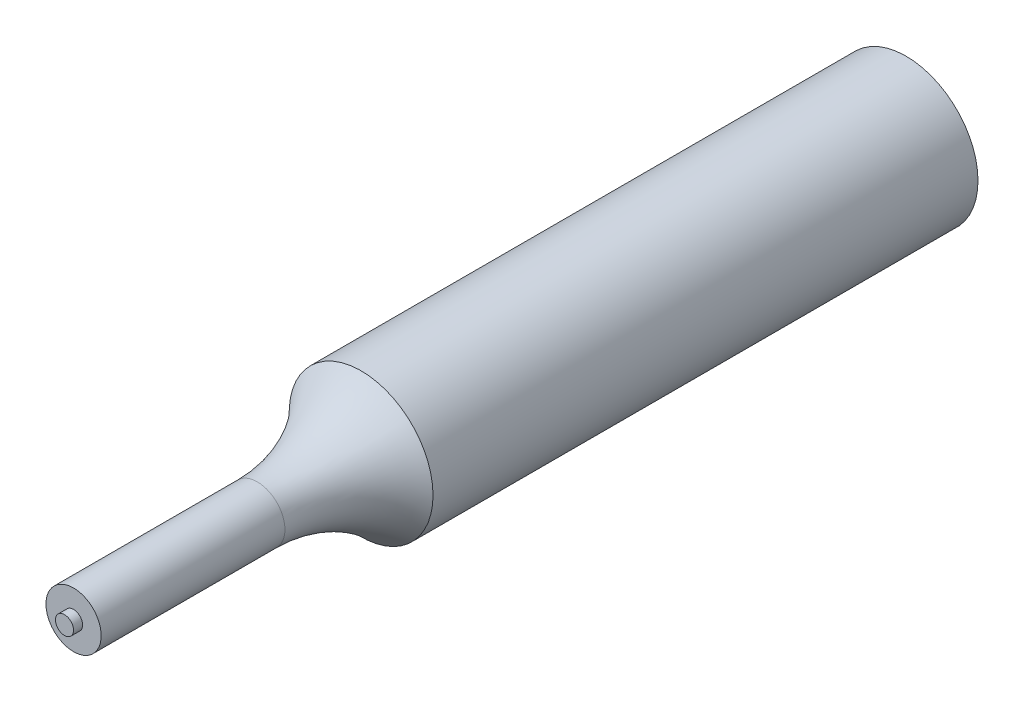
ISO-10303-21;
HEADER;
FILE_DESCRIPTION(('STEP AP214'),'2;1');
FILE_NAME('part.step','',(''),(''),'','','');
FILE_SCHEMA(('AUTOMOTIVE_DESIGN { 1 0 10303 214 1 1 1 1 }'));
ENDSEC;
DATA;
#1=APPLICATION_CONTEXT('core data for automotive mechanical design processes');
#2=APPLICATION_PROTOCOL_DEFINITION('international standard','automotive_design',2000,#1);
#3=PRODUCT_CONTEXT('',#1,'mechanical');
#4=PRODUCT('Part','Part','',(#3));
#5=PRODUCT_RELATED_PRODUCT_CATEGORY('part','',(#4));
#6=PRODUCT_DEFINITION_FORMATION('','',#4);
#7=PRODUCT_DEFINITION_CONTEXT('part definition',#1,'design');
#8=PRODUCT_DEFINITION('design','',#6,#7);
#9=PRODUCT_DEFINITION_SHAPE('','',#8);
#10=(LENGTH_UNIT() NAMED_UNIT(*) SI_UNIT(.MILLI.,.METRE.));
#11=(NAMED_UNIT(*) PLANE_ANGLE_UNIT() SI_UNIT($,.RADIAN.));
#12=(NAMED_UNIT(*) SI_UNIT($,.STERADIAN.) SOLID_ANGLE_UNIT());
#13=UNCERTAINTY_MEASURE_WITH_UNIT(LENGTH_MEASURE(1.E-05),#10,'distance_accuracy_value','');
#14=(GEOMETRIC_REPRESENTATION_CONTEXT(3) GLOBAL_UNCERTAINTY_ASSIGNED_CONTEXT((#13)) GLOBAL_UNIT_ASSIGNED_CONTEXT((#10,
#11,#12)) REPRESENTATION_CONTEXT('',''));
#15=CARTESIAN_POINT('',(0.,0.,0.));
#16=DIRECTION('',(0.,0.,1.));
#17=DIRECTION('',(1.,0.,0.));
#18=AXIS2_PLACEMENT_3D('',#15,#16,#17);
#19=CARTESIAN_POINT('',(-6.35,0.,6.35));
#20=DIRECTION('',(0.,0.,1.));
#21=DIRECTION('',(1.,0.,0.));
#22=AXIS2_PLACEMENT_3D('',#19,#20,#21);
#23=PLANE('',#22);
#24=CARTESIAN_POINT('',(0.,0.,6.35));
#25=DIRECTION('',(0.,0.,1.));
#26=DIRECTION('',(1.,0.,0.));
#27=AXIS2_PLACEMENT_3D('',#24,#25,#26);
#28=CIRCLE('',#27,6.35);
#29=CARTESIAN_POINT('',(6.35,0.,6.35));
#30=VERTEX_POINT('',#29);
#31=EDGE_CURVE('E64',#30,#30,#28,.T.);
#32=ORIENTED_EDGE('',*,*,#31,.F.);
#33=EDGE_LOOP('',(#32));
#34=FACE_BOUND('',#33,.T.);
#35=ADVANCED_FACE('F41',(#34),#23,.F.);
#36=CARTESIAN_POINT('',(0.,0.,43.5171681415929));
#37=DIRECTION('',(0.,0.,1.));
#38=DIRECTION('',(1.,0.,0.));
#39=AXIS2_PLACEMENT_3D('',#36,#37,#38);
#40=CYLINDRICAL_SURFACE('',#39,6.35);
#41=CARTESIAN_POINT('',(-4.84267088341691,-4.10743700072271,25.179099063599));
#42=CARTESIAN_POINT('',(-4.91031116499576,-4.02766520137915,24.7923213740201));
#43=CARTESIAN_POINT('',(-4.97622022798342,-3.94598660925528,24.4056305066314));
#44=CARTESIAN_POINT('',(-5.10457037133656,-3.77849789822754,23.6325148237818));
#45=CARTESIAN_POINT('',(-5.16701100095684,-3.69268724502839,23.246090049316));
#46=CARTESIAN_POINT('',(-5.28869128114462,-3.51621627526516,22.471853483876));
#47=CARTESIAN_POINT('',(-5.3479142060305,-3.42553473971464,22.0840438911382));
#48=CARTESIAN_POINT('',(-5.46281264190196,-3.23916217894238,21.3091382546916));
#49=CARTESIAN_POINT('',(-5.51848847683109,-3.1434716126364,20.9220421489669));
#50=CARTESIAN_POINT('',(-5.62775930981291,-2.94349561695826,20.1381975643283));
#51=CARTESIAN_POINT('',(-5.68125471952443,-2.83904602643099,19.7414769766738));
#52=CARTESIAN_POINT('',(-5.78445697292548,-2.62240574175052,18.9495188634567));
#53=CARTESIAN_POINT('',(-5.83416278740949,-2.51021296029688,18.5542817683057));
#54=CARTESIAN_POINT('',(-5.90576107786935,-2.33419370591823,17.9638277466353));
#55=CARTESIAN_POINT('',(-5.9291108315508,-2.27429911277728,17.7676144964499));
#56=CARTESIAN_POINT('',(-5.9748282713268,-2.15133460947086,17.3760731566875));
#57=CARTESIAN_POINT('',(-5.99719599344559,-2.08826481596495,17.1807450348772));
#58=CARTESIAN_POINT('',(-6.04091673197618,-1.95819561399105,16.7913811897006));
#59=CARTESIAN_POINT('',(-6.06227019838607,-1.89119797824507,16.5973449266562));
#60=CARTESIAN_POINT('',(-6.10393304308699,-1.75208332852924,16.2110122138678));
#61=CARTESIAN_POINT('',(-6.12424257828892,-1.67996708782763,16.0187155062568));
#62=CARTESIAN_POINT('',(-6.15380231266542,-1.56675228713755,15.7329471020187));
#63=CARTESIAN_POINT('',(-6.16347241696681,-1.52831758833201,15.63846410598));
#64=CARTESIAN_POINT('',(-6.1825245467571,-1.4493256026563,15.450339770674));
#65=CARTESIAN_POINT('',(-6.19190652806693,-1.40876799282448,15.3566985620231));
#66=CARTESIAN_POINT('',(-6.21036679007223,-1.32502361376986,15.1704738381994));
#67=CARTESIAN_POINT('',(-6.21944483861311,-1.28183490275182,15.0778911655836));
#68=CARTESIAN_POINT('',(-6.23725256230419,-1.19216789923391,14.8943241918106));
#69=CARTESIAN_POINT('',(-6.24598231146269,-1.1456903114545,14.8033395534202));
#70=CARTESIAN_POINT('',(-6.26502899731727,-1.03713912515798,14.6026879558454));
#71=CARTESIAN_POINT('',(-6.27524324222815,-0.973951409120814,14.4935938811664));
#72=CARTESIAN_POINT('',(-6.28993321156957,-0.872007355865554,14.3346767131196));
#73=CARTESIAN_POINT('',(-6.29471851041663,-0.836885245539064,14.2825598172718));
#74=CARTESIAN_POINT('',(-6.30403025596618,-0.76359266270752,14.1805061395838));
#75=CARTESIAN_POINT('',(-6.30855685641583,-0.725424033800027,14.1305680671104));
#76=CARTESIAN_POINT('',(-6.3167242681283,-0.650185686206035,14.0399236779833));
#77=CARTESIAN_POINT('',(-6.32040505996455,-0.613575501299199,13.9988438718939));
#78=CARTESIAN_POINT('',(-6.32741951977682,-0.536439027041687,13.9201768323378));
#79=CARTESIAN_POINT('',(-6.33075208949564,-0.495901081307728,13.8826006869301));
#80=CARTESIAN_POINT('',(-6.33694554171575,-0.409326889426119,13.8124695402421));
#81=CARTESIAN_POINT('',(-6.33979699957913,-0.363205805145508,13.7800155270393));
#82=CARTESIAN_POINT('',(-6.34463224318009,-0.265487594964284,13.7248093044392));
#83=CARTESIAN_POINT('',(-6.34662196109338,-0.213931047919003,13.7019907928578));
#84=CARTESIAN_POINT('',(-6.34875500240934,-0.129467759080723,13.6774958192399));
#85=CARTESIAN_POINT('',(-6.34932391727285,-0.097991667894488,13.6709525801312));
#86=CARTESIAN_POINT('',(-6.34998629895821,-0.0343716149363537,13.6633332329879));
#87=CARTESIAN_POINT('',(-6.35008005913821,-0.00222807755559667,13.6622537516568));
#88=CARTESIAN_POINT('',(-6.34978056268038,0.0617275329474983,13.6656997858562));
#89=CARTESIAN_POINT('',(-6.34938755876,0.0935397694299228,13.6702223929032));
#90=CARTESIAN_POINT('',(-6.34816036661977,0.156013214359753,13.6843262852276));
#91=CARTESIAN_POINT('',(-6.34732566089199,0.186673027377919,13.6939135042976));
#92=CARTESIAN_POINT('',(-6.34482209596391,0.260065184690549,13.7226150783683));
#93=CARTESIAN_POINT('',(-6.34294612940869,0.301858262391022,13.7440834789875));
#94=CARTESIAN_POINT('',(-6.33864739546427,0.38165159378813,13.793095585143));
#95=CARTESIAN_POINT('',(-6.33622323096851,0.419641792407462,13.8206548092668));
#96=CARTESIAN_POINT('',(-6.33048242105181,0.499390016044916,13.8856462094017));
#97=CARTESIAN_POINT('',(-6.32708403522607,0.540416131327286,13.9239538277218));
#98=CARTESIAN_POINT('',(-6.31991582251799,0.618632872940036,14.0043143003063));
#99=CARTESIAN_POINT('',(-6.31614532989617,0.655816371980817,14.0463738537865));
#100=CARTESIAN_POINT('',(-6.30831294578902,0.727315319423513,14.1332452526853));
#101=CARTESIAN_POINT('',(-6.30424941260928,0.761611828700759,14.1780723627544));
#102=CARTESIAN_POINT('',(-6.29591643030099,0.827671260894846,14.2694579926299));
#103=CARTESIAN_POINT('',(-6.29164716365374,0.859436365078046,14.3160149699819));
#104=CARTESIAN_POINT('',(-6.27903822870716,0.948507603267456,14.4526950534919));
#105=CARTESIAN_POINT('',(-6.27047768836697,1.00320772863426,14.5444903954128));
#106=CARTESIAN_POINT('',(-6.25289089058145,1.10753607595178,14.7308978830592));
#107=CARTESIAN_POINT('',(-6.24386430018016,1.15716059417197,14.8255120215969));
#108=CARTESIAN_POINT('',(-6.22540152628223,1.2526961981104,15.01681191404));
#109=CARTESIAN_POINT('',(-6.21596447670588,1.29859878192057,15.1135018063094));
#110=CARTESIAN_POINT('',(-6.1967416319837,1.38742561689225,15.3082116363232));
#111=CARTESIAN_POINT('',(-6.18695578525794,1.43034942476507,15.4062317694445));
#112=CARTESIAN_POINT('',(-6.15702657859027,1.55595508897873,15.7026425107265));
#113=CARTESIAN_POINT('',(-6.13639643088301,1.63504712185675,15.9025024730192));
#114=CARTESIAN_POINT('',(-6.0939967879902,1.78657264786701,16.3042250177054));
#115=CARTESIAN_POINT('',(-6.0722290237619,1.85901581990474,16.5060841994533));
#116=CARTESIAN_POINT('',(-6.03036939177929,1.99029543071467,16.8860423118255));
#117=CARTESIAN_POINT('',(-6.01040779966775,2.04970121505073,17.0639597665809));
#118=CARTESIAN_POINT('',(-5.9696550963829,2.1655203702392,17.4206719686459));
#119=CARTESIAN_POINT('',(-5.94886396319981,2.22193366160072,17.5994667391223));
#120=CARTESIAN_POINT('',(-5.88526310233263,2.38751102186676,18.1368946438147));
#121=CARTESIAN_POINT('',(-5.84123182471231,2.49299442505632,18.4965176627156));
#122=CARTESIAN_POINT('',(-5.74991915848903,2.69692067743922,19.2179005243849));
#123=CARTESIAN_POINT('',(-5.7026330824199,2.79535293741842,19.5796627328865));
#124=CARTESIAN_POINT('',(-5.60490949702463,2.98647037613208,20.3042400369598));
#125=CARTESIAN_POINT('',(-5.55447226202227,3.0791560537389,20.6670550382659));
#126=CARTESIAN_POINT('',(-5.45303116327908,3.25526543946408,21.3755236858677));
#127=CARTESIAN_POINT('',(-5.40217781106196,3.33892049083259,21.7211416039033));
#128=CARTESIAN_POINT('',(-5.29765509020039,3.50239341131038,22.4128681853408));
#129=CARTESIAN_POINT('',(-5.24398564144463,3.58221117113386,22.7589768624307));
#130=CARTESIAN_POINT('',(-5.13398766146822,3.73814880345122,23.4506312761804));
#131=CARTESIAN_POINT('',(-5.07766643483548,3.81427778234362,23.7961761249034));
#132=CARTESIAN_POINT('',(-4.9622484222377,3.96326100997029,24.487489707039));
#133=CARTESIAN_POINT('',(-4.90315177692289,4.03611542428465,24.8332584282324));
#134=CARTESIAN_POINT('',(-4.84267088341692,4.10743700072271,25.179099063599));
#135=B_SPLINE_CURVE_WITH_KNOTS('',3,(#41,#42,#43,#44,#45,#46,#47,#48,#49,#50,#51,#52,#53,#54,
#55,#56,#57,#58,#59,#60,#61,#62,#63,#64,#65,#66,#67,#68,#69,#70,#71,#72,#73,#74,#75,#76,#77,#78,
#79,#80,#81,#82,#83,#84,#85,#86,#87,#88,#89,#90,#91,#92,#93,#94,#95,#96,#97,#98,#99,#100,#101,
#102,#103,#104,#105,#106,#107,#108,#109,#110,#111,#112,#113,#114,#115,#116,#117,#118,#119,#120,
#121,#122,#123,#124,#125,#126,#127,#128,#129,#130,#131,#132,#133,#134),.UNSPECIFIED.,.F.,.F.,(4,
2,2,2,2,2,2,2,2,2,2,2,2,2,2,2,2,2,2,2,2,2,2,2,2,2,2,2,2,2,2,2,2,2,2,2,2,2,2,2,2,2,2,2,2,2,4),
(0.,1.20200424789,2.40416434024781,3.61207023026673,4.81986564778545,6.06093657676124,
7.3023433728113,7.92174916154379,8.54113220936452,9.16023783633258,9.77925013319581,
10.0866059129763,10.3940085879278,10.7016409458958,11.0092075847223,11.3882604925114,
11.5772698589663,11.7661657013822,11.9314380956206,12.0972169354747,12.2659389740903,
12.4334803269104,12.5295220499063,12.6255044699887,12.7214370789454,12.8174823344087,
12.9577382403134,13.0983557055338,13.2666724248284,13.4352959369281,13.6049511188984,
13.7744584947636,14.0957863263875,14.4173469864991,14.7396226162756,15.0619461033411,
15.7095337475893,16.3561632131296,16.9220256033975,17.4879030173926,18.6198287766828,
19.7534202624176,20.8869132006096,21.9645270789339,23.0421716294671,24.1170039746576,
25.1917819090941),.UNSPECIFIED.);
#136=CARTESIAN_POINT('',(-4.84270585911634,-4.10739576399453,25.178899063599));
#137=VERTEX_POINT('',#136);
#138=CARTESIAN_POINT('',(-4.84270585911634,4.10739576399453,25.178899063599));
#139=VERTEX_POINT('',#138);
#140=EDGE_CURVE('E53',#137,#139,#135,.T.);
#141=ORIENTED_EDGE('',*,*,#140,.T.);
#142=CARTESIAN_POINT('',(-4.84274083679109,4.10735452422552,25.178699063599));
#143=CARTESIAN_POINT('',(-4.82778505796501,4.12498432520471,25.2642011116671));
#144=CARTESIAN_POINT('',(-4.81391554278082,4.14114605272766,25.3501839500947));
#145=CARTESIAN_POINT('',(-4.78843682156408,4.17058235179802,25.5229713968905));
#146=CARTESIAN_POINT('',(-4.77682752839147,4.18385703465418,25.6097759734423));
#147=CARTESIAN_POINT('',(-4.74552601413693,4.21941907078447,25.8711726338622));
#148=CARTESIAN_POINT('',(-4.72935149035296,4.23745445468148,26.0467967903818));
#149=CARTESIAN_POINT('',(-4.70687228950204,4.26240911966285,26.3992920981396));
#150=CARTESIAN_POINT('',(-4.70055959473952,4.2693374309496,26.5761621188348));
#151=CARTESIAN_POINT('',(-4.69795117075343,4.27220782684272,26.9300713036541));
#152=CARTESIAN_POINT('',(-4.70165544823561,4.26814990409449,27.1071104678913));
#153=CARTESIAN_POINT('',(-4.71897998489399,4.24898741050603,27.4601380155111));
#154=CARTESIAN_POINT('',(-4.73260227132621,4.23388058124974,27.6361261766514));
#155=CARTESIAN_POINT('',(-4.76937959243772,4.19240808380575,27.9857641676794));
#156=CARTESIAN_POINT('',(-4.7925344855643,4.16604258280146,28.1594140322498));
#157=CARTESIAN_POINT('',(-4.84774007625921,4.10167211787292,28.5032635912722));
#158=CARTESIAN_POINT('',(-4.87979819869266,4.06365743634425,28.6734602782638));
#159=CARTESIAN_POINT('',(-4.95186919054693,3.97551642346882,29.0089658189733));
#160=CARTESIAN_POINT('',(-4.99188180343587,3.9253904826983,29.174274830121));
#161=CARTESIAN_POINT('',(-5.07839446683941,3.81279638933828,29.4976725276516));
#162=CARTESIAN_POINT('',(-5.12485267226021,3.7504068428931,29.6557996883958));
#163=CARTESIAN_POINT('',(-5.22300975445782,3.61245558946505,29.9645528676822));
#164=CARTESIAN_POINT('',(-5.27470937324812,3.53689201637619,30.1151778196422));
#165=CARTESIAN_POINT('',(-5.38153845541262,3.37211531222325,30.4071255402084));
#166=CARTESIAN_POINT('',(-5.43666145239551,3.28292747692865,30.5484648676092));
#167=CARTESIAN_POINT('',(-5.54839270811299,3.09034366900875,30.8203586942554));
#168=CARTESIAN_POINT('',(-5.6050001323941,2.98695554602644,30.9509190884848));
#169=CARTESIAN_POINT('',(-5.73575781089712,2.72958441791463,31.2398599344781));
#170=CARTESIAN_POINT('',(-5.80964177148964,2.57006859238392,31.3935253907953));
#171=CARTESIAN_POINT('',(-5.94999250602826,2.22586739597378,31.6735119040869));
#172=CARTESIAN_POINT('',(-6.01646933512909,2.04121692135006,31.7998702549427));
#173=CARTESIAN_POINT('',(-6.12661056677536,1.67853475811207,32.0033402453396));
#174=CARTESIAN_POINT('',(-6.17220015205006,1.5036488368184,32.0849920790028));
#175=CARTESIAN_POINT('',(-6.24945896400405,1.14066295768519,32.2212052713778));
#176=CARTESIAN_POINT('',(-6.28113389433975,0.952568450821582,32.2757777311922));
#177=CARTESIAN_POINT('',(-6.32759988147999,0.567245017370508,32.3552820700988));
#178=CARTESIAN_POINT('',(-6.34231672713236,0.36997984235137,32.3800836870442));
#179=CARTESIAN_POINT('',(-6.35303742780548,-0.0264934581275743,32.3981855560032));
#180=CARTESIAN_POINT('',(-6.34904531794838,-0.225701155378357,32.3914926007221));
#181=CARTESIAN_POINT('',(-6.32381747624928,-0.604217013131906,32.348741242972));
#182=CARTESIAN_POINT('',(-6.30392380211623,-0.783881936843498,32.3149677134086));
#183=CARTESIAN_POINT('',(-6.25035432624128,-1.13447691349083,32.2225274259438));
#184=CARTESIAN_POINT('',(-6.2166775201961,-1.30540632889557,32.163858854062));
#185=CARTESIAN_POINT('',(-6.13661815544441,-1.64181908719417,32.0211252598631));
#186=CARTESIAN_POINT('',(-6.08976678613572,-1.80678298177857,31.9361083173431));
#187=CARTESIAN_POINT('',(-5.98761405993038,-2.12092270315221,31.7447907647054));
#188=CARTESIAN_POINT('',(-5.93230913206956,-2.27009181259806,31.6384811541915));
#189=CARTESIAN_POINT('',(-5.80805712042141,-2.57287640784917,31.3900563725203));
#190=CARTESIAN_POINT('',(-5.73831546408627,-2.72370504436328,31.2449535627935));
#191=CARTESIAN_POINT('',(-5.597501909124,-3.00248431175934,30.9348584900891));
#192=CARTESIAN_POINT('',(-5.52642919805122,-3.13042043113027,30.7698537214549));
#193=CARTESIAN_POINT('',(-5.37258921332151,-3.3889544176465,30.3867779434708));
#194=CARTESIAN_POINT('',(-5.29055334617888,-3.51432090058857,30.1648879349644));
#195=CARTESIAN_POINT('',(-5.13756021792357,-3.73443399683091,29.7027754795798));
#196=CARTESIAN_POINT('',(-5.06661028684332,-3.82916039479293,29.462541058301));
#197=CARTESIAN_POINT('',(-4.96612833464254,-3.95774564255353,29.0680319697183));
#198=CARTESIAN_POINT('',(-4.93140309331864,-4.00077389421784,28.9179624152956));
#199=CARTESIAN_POINT('',(-4.86853784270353,-4.07704497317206,28.6139655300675));
#200=CARTESIAN_POINT('',(-4.84039854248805,-4.11028674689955,28.4600377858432));
#201=CARTESIAN_POINT('',(-4.7913747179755,-4.16733029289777,28.1492190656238));
#202=CARTESIAN_POINT('',(-4.77049440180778,-4.19112659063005,27.9923264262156));
#203=CARTESIAN_POINT('',(-4.73649217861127,-4.22951508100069,27.6765841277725));
#204=CARTESIAN_POINT('',(-4.72337063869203,-4.24410683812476,27.5177343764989));
#205=CARTESIAN_POINT('',(-4.70387409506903,-4.26571477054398,27.1758262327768));
#206=CARTESIAN_POINT('',(-4.69875640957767,-4.27132212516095,26.9926040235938));
#207=CARTESIAN_POINT('',(-4.69926159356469,-4.27076530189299,26.6261810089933));
#208=CARTESIAN_POINT('',(-4.70488591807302,-4.26459952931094,26.4429802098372));
#209=CARTESIAN_POINT('',(-4.72672167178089,-4.24038596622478,26.0778195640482));
#210=CARTESIAN_POINT('',(-4.7429417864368,-4.22232842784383,25.8958608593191));
#211=CARTESIAN_POINT('',(-4.77483486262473,-4.18613195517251,25.6250866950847));
#212=CARTESIAN_POINT('',(-4.78672780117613,-4.17254644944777,25.5351811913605));
#213=CARTESIAN_POINT('',(-4.81293920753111,-4.14228327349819,25.3562452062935));
#214=CARTESIAN_POINT('',(-4.8272577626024,-4.12560549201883,25.2672147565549));
#215=CARTESIAN_POINT('',(-4.84274083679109,-4.10735452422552,25.178699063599));
#216=B_SPLINE_CURVE_WITH_KNOTS('',3,(#142,#143,#144,#145,#146,#147,#148,#149,#150,#151,#152,
#153,#154,#155,#156,#157,#158,#159,#160,#161,#162,#163,#164,#165,#166,#167,#168,#169,#170,#171,
#172,#173,#174,#175,#176,#177,#178,#179,#180,#181,#182,#183,#184,#185,#186,#187,#188,#189,#190,
#191,#192,#193,#194,#195,#196,#197,#198,#199,#200,#201,#202,#203,#204,#205,#206,#207,#208,#209,
#210,#211,#212,#213,#214,#215),.UNSPECIFIED.,.F.,.F.,(4,2,2,2,2,2,2,2,2,2,2,2,2,2,2,2,2,2,2,2,2,
2,2,2,2,2,2,2,2,2,2,2,2,2,2,2,4),(0.,0.265674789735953,0.531339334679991,1.06251621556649,
1.59326102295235,2.12400618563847,2.65485986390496,3.18570565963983,3.71699549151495,
4.24826819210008,4.77624054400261,5.30428774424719,5.83136619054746,6.35815444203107,
7.05583513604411,7.75255688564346,8.34499992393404,8.93719989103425,9.53198168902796,
10.1266352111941,10.6758124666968,11.2250297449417,11.7970130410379,12.3692386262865,
13.0286701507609,13.6885182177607,14.4888375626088,15.2896838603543,15.7690530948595,
16.2484739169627,16.7281722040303,17.2078931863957,17.7573186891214,18.3068186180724,
18.856769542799,19.1317951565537,19.4068306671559),.UNSPECIFIED.);
#217=EDGE_CURVE('E11',#139,#137,#216,.T.);
#218=ORIENTED_EDGE('',*,*,#217,.T.);
#219=EDGE_LOOP('',(#141,#218));
#220=FACE_BOUND('',#219,.T.);
#221=CARTESIAN_POINT('',(0.,0.,54.483));
#222=DIRECTION('',(0.,0.,1.));
#223=DIRECTION('',(1.,0.,0.));
#224=AXIS2_PLACEMENT_3D('',#221,#222,#223);
#225=CIRCLE('',#224,6.34999999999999);
#226=CARTESIAN_POINT('',(6.34999999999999,0.,54.483));
#227=VERTEX_POINT('',#226);
#228=EDGE_CURVE('E76',#227,#227,#225,.T.);
#229=ORIENTED_EDGE('',*,*,#228,.F.);
#230=EDGE_LOOP('',(#229));
#231=FACE_BOUND('',#230,.T.);
#232=ORIENTED_EDGE('',*,*,#31,.T.);
#233=EDGE_LOOP('',(#232));
#234=FACE_BOUND('',#233,.T.);
#235=ADVANCED_FACE('F69',(#220,#231,#234),#40,.T.);
#236=CARTESIAN_POINT('',(0.,0.,63.6510982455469));
#237=DIRECTION('',(0.,0.,1.));
#238=DIRECTION('',(1.,0.,0.));
#239=AXIS2_PLACEMENT_3D('',#236,#237,#238);
#240=TOROIDAL_SURFACE('',#239,15.1384,12.7);
#241=CARTESIAN_POINT('',(0.,0.,63.6510982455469));
#242=DIRECTION('',(0.,0.,1.));
#243=DIRECTION('',(1.,0.,0.));
#244=AXIS2_PLACEMENT_3D('',#241,#242,#243);
#245=CIRCLE('',#244,2.43839999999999);
#246=CARTESIAN_POINT('',(2.43839999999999,0.,63.6510982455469));
#247=VERTEX_POINT('',#246);
#248=EDGE_CURVE('E81',#247,#247,#245,.T.);
#249=ORIENTED_EDGE('',*,*,#248,.F.);
#250=EDGE_LOOP('',(#249));
#251=FACE_BOUND('',#250,.T.);
#252=ORIENTED_EDGE('',*,*,#228,.T.);
#253=EDGE_LOOP('',(#252));
#254=FACE_BOUND('',#253,.T.);
#255=ADVANCED_FACE('F72',(#251,#254),#240,.F.);
#256=CARTESIAN_POINT('',(0.,0.,43.5171681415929));
#257=DIRECTION('',(0.,0.,1.));
#258=DIRECTION('',(1.,0.,0.));
#259=AXIS2_PLACEMENT_3D('',#256,#257,#258);
#260=CYLINDRICAL_SURFACE('',#259,2.43839999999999);
#261=CARTESIAN_POINT('',(0.,0.,79.883));
#262=DIRECTION('',(0.,0.,1.));
#263=DIRECTION('',(1.,0.,0.));
#264=AXIS2_PLACEMENT_3D('',#261,#262,#263);
#265=CIRCLE('',#264,2.43839999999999);
#266=CARTESIAN_POINT('',(2.43839999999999,0.,79.883));
#267=VERTEX_POINT('',#266);
#268=EDGE_CURVE('E87',#267,#267,#265,.T.);
#269=ORIENTED_EDGE('',*,*,#268,.F.);
#270=EDGE_LOOP('',(#269));
#271=FACE_BOUND('',#270,.T.);
#272=ORIENTED_EDGE('',*,*,#248,.T.);
#273=EDGE_LOOP('',(#272));
#274=FACE_BOUND('',#273,.T.);
#275=ADVANCED_FACE('F111',(#271,#274),#260,.T.);
#276=CARTESIAN_POINT('',(0.,0.,79.883));
#277=DIRECTION('',(0.,0.,-1.));
#278=DIRECTION('',(-1.,0.,0.));
#279=AXIS2_PLACEMENT_3D('',#276,#277,#278);
#280=PLANE('',#279);
#281=CARTESIAN_POINT('',(0.,0.,79.883));
#282=DIRECTION('',(0.,0.,-1.));
#283=DIRECTION('',(-1.,0.,0.));
#284=AXIS2_PLACEMENT_3D('',#281,#282,#283);
#285=CIRCLE('',#284,0.800100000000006);
#286=CARTESIAN_POINT('',(-0.80009999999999,0.,79.883));
#287=VERTEX_POINT('',#286);
#288=EDGE_CURVE('E85',#287,#287,#285,.T.);
#289=ORIENTED_EDGE('',*,*,#288,.T.);
#290=EDGE_LOOP('',(#289));
#291=FACE_BOUND('',#290,.T.);
#292=ORIENTED_EDGE('',*,*,#268,.T.);
#293=EDGE_LOOP('',(#292));
#294=FACE_BOUND('',#293,.T.);
#295=ADVANCED_FACE('F104',(#291,#294),#280,.F.);
#296=CARTESIAN_POINT('',(0.,0.,0.));
#297=DIRECTION('',(0.,0.,-1.));
#298=DIRECTION('',(-1.,0.,0.));
#299=AXIS2_PLACEMENT_3D('',#296,#297,#298);
#300=CYLINDRICAL_SURFACE('',#299,0.800100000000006);
#301=CARTESIAN_POINT('',(0.,0.,80.6831));
#302=DIRECTION('',(0.,0.,-1.));
#303=DIRECTION('',(-1.,0.,0.));
#304=AXIS2_PLACEMENT_3D('',#301,#302,#303);
#305=CIRCLE('',#304,0.800100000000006);
#306=CARTESIAN_POINT('',(-0.80009999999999,0.,80.6831));
#307=VERTEX_POINT('',#306);
#308=EDGE_CURVE('E67',#307,#307,#305,.T.);
#309=ORIENTED_EDGE('',*,*,#308,.T.);
#310=EDGE_LOOP('',(#309));
#311=FACE_BOUND('',#310,.T.);
#312=ORIENTED_EDGE('',*,*,#288,.F.);
#313=EDGE_LOOP('',(#312));
#314=FACE_BOUND('',#313,.T.);
#315=ADVANCED_FACE('F101',(#311,#314),#300,.T.);
#316=CARTESIAN_POINT('',(0.,0.,80.6831));
#317=DIRECTION('',(0.,0.,1.));
#318=DIRECTION('',(1.,0.,0.));
#319=AXIS2_PLACEMENT_3D('',#316,#317,#318);
#320=PLANE('',#319);
#321=ORIENTED_EDGE('',*,*,#308,.F.);
#322=EDGE_LOOP('',(#321));
#323=FACE_BOUND('',#322,.T.);
#324=ADVANCED_FACE('F100',(#323),#320,.T.);
#325=CARTESIAN_POINT('',(-9.398,0.,26.8224));
#326=DIRECTION('',(0.,0.,-1.));
#327=DIRECTION('',(-1.,0.,0.));
#328=AXIS2_PLACEMENT_3D('',#325,#326,#327);
#329=SPHERICAL_SURFACE('',#328,6.35);
#330=CARTESIAN_POINT('',(-9.398,0.,25.178899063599));
#331=DIRECTION('',(0.,0.,-1.));
#332=DIRECTION('',(-1.,0.,0.));
#333=AXIS2_PLACEMENT_3D('',#330,#331,#332);
#334=CIRCLE('',#333,6.1336289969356);
#335=EDGE_CURVE('E59',#139,#137,#334,.T.);
#336=ORIENTED_EDGE('',*,*,#335,.T.);
#337=ORIENTED_EDGE('',*,*,#217,.F.);
#338=EDGE_LOOP('',(#336,#337));
#339=FACE_BOUND('',#338,.T.);
#340=ADVANCED_FACE('F66',(#339),#329,.F.);
#341=CARTESIAN_POINT('',(-9.398,0.,2.28788401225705));
#342=DIRECTION('',(0.,0.,1.));
#343=DIRECTION('',(1.,0.,0.));
#344=AXIS2_PLACEMENT_3D('',#341,#342,#343);
#345=CONICAL_SURFACE('',#344,0.,0.261799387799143);
#346=ORIENTED_EDGE('',*,*,#335,.F.);
#347=ORIENTED_EDGE('',*,*,#140,.F.);
#348=EDGE_LOOP('',(#346,#347));
#349=FACE_BOUND('',#348,.T.);
#350=ADVANCED_FACE('F62',(#349),#345,.F.);
#351=CLOSED_SHELL('',(#35,#235,#255,#275,#295,#315,#324,#340,#350));
#352=MANIFOLD_SOLID_BREP('B2',#351);
#353=ADVANCED_BREP_SHAPE_REPRESENTATION('',(#18,#352),#14);
#354=SHAPE_DEFINITION_REPRESENTATION(#9,#353);
ENDSEC;
END-ISO-10303-21;
